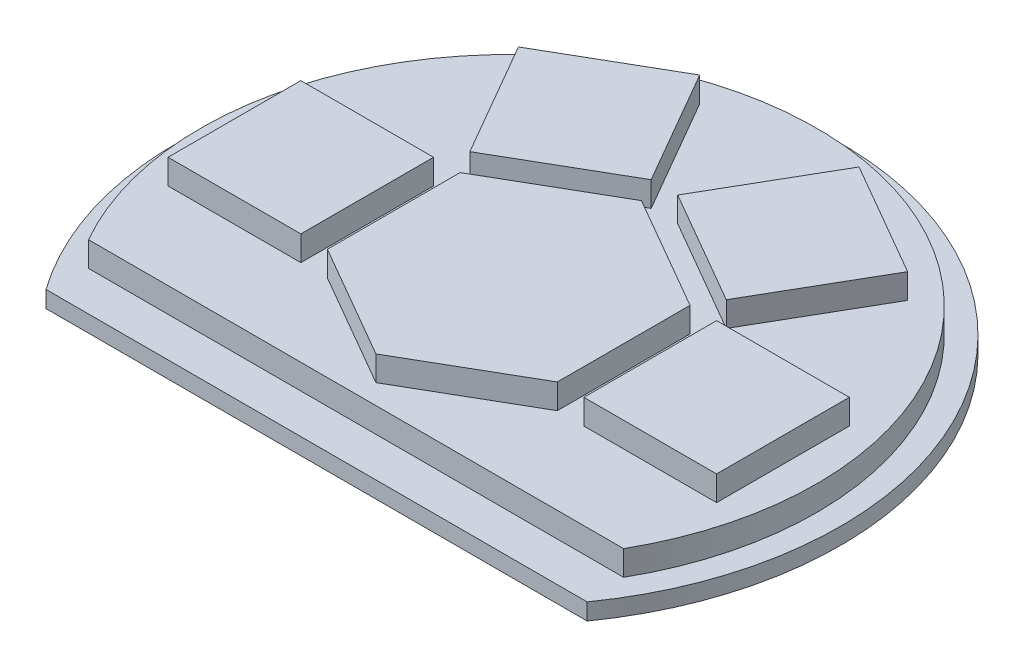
from build123d import *

# Parameters (mm, degrees)
PAWPRINT_DEPTH   = 25.4
SKETCH1_W        = 50.8
SKETCH1_H        = 50.8
PAWPRINT_2_DEPTH = 25.4
PAWPRINT_3_DEPTH = 25.4
PAWPRINT_4_DEPTH = 25.4
PAWPRINT_5_DEPTH = 25.4
PLATE_DEPTH      = 15.875
MILLBASE_DEPTH   = 6.35


with BuildPart() as part:
    # Sketch1 → pawprint (new body)
    with BuildSketch(Plane(origin=(0, 0, 0), x_dir=(1, 0, 0), z_dir=(0, 1, 0))):
        Polygon((0, 50.8), (-43.994090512, 25.4), (-43.994090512, -25.4), (0, -50.8), (43.994090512, -25.4), (43.994090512, 25.4), align=None)
    extrude(amount=PAWPRINT_DEPTH)



with BuildPart() as body_2:
    # Sketch1 → pawprint 2 (new body)
    with BuildSketch(Plane(origin=(0, 0, 0), x_dir=(1, 0, 0), z_dir=(0, 1, 0))):
        with Locations((-79.554090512, 0)):
            Rectangle(SKETCH1_W, SKETCH1_H)
    extrude(amount=PAWPRINT_2_DEPTH)


with BuildPart() as body_3:
    # Sketch1 → pawprint 3 (new body)
    with BuildSketch(Plane(origin=(0, 0, 0), x_dir=(1, 0, 0), z_dir=(0, 1, 0))):
        with Locations((79.554090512, 0)):
            Rectangle(SKETCH1_W, SKETCH1_H)
    extrude(amount=PAWPRINT_3_DEPTH)


with BuildPart() as body_4:
    # Sketch1 → pawprint 4 (new body)
    with BuildSketch(Plane(origin=(0, 0, 0), x_dir=(1, 0, 0), z_dir=(0, 1, 0))):
        Polygon((30.48, 103.592908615), (5.08, 59.598818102), (49.074090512, 34.198818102), (74.474090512, 78.192908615), align=None)
    extrude(amount=PAWPRINT_4_DEPTH)


with BuildPart() as body_5:
    # Sketch1 → pawprint 5 (new body)
    with BuildSketch(Plane(origin=(0, 0, 0), x_dir=(1, 0, 0), z_dir=(0, 1, 0))):
        Polygon((-74.474090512, 78.192908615), (-30.48, 103.592908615), (-5.08, 59.598818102), (-49.074090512, 34.198818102), align=None)
    extrude(amount=PAWPRINT_5_DEPTH)


with BuildPart() as part_1:
    add(part.part)

    add(body_2.part)  # plate merges body 2

    add(body_3.part)  # plate merges body 3

    add(body_4.part)  # plate merges body 4

    add(body_5.part)  # plate merges body 5
    # Sketch2 → plate (add)
    with BuildSketch(Plane.XZ):
        with BuildLine():
            ThreePointArc((117.876472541, 0), (113.936890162, 30.219990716), (102.381474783, 58.42))
            Line((102.381474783, 58.42), (-102.381474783, 58.42))
            ThreePointArc((-102.381474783, 58.42), (-30.219990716, -113.936890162), (117.876472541, 0))
        make_face()
        Polygon((43.994090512, -25.4), (0, -50.8), (-43.994090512, -25.4), (-43.994090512, 25.4), (0, 50.8), (43.994090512, 25.4), align=None, mode=Mode.SUBTRACT)
    extrude(amount=-PLATE_DEPTH)

    # Sketch3 → millbase (add)
    with BuildSketch(Plane.XZ):
        with BuildLine():
            Line((103.552305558, 73.524961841), (-103.552305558, 73.524961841))
            ThreePointArc((-103.552305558, 73.524961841), (-38.586637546, -120.996162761), (127, 0))
            ThreePointArc((127, 0), (120.996162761, 38.586637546), (103.552305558, 73.524961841))
        make_face()
        with BuildLine():
            Line((-102.381474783, 58.42), (102.381474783, 58.42))
            ThreePointArc((102.381474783, 58.42), (0, -117.876472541), (-102.381474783, 58.42))
        make_face(mode=Mode.SUBTRACT)
    extrude(amount=-MILLBASE_DEPTH)


solid = part_1.part
